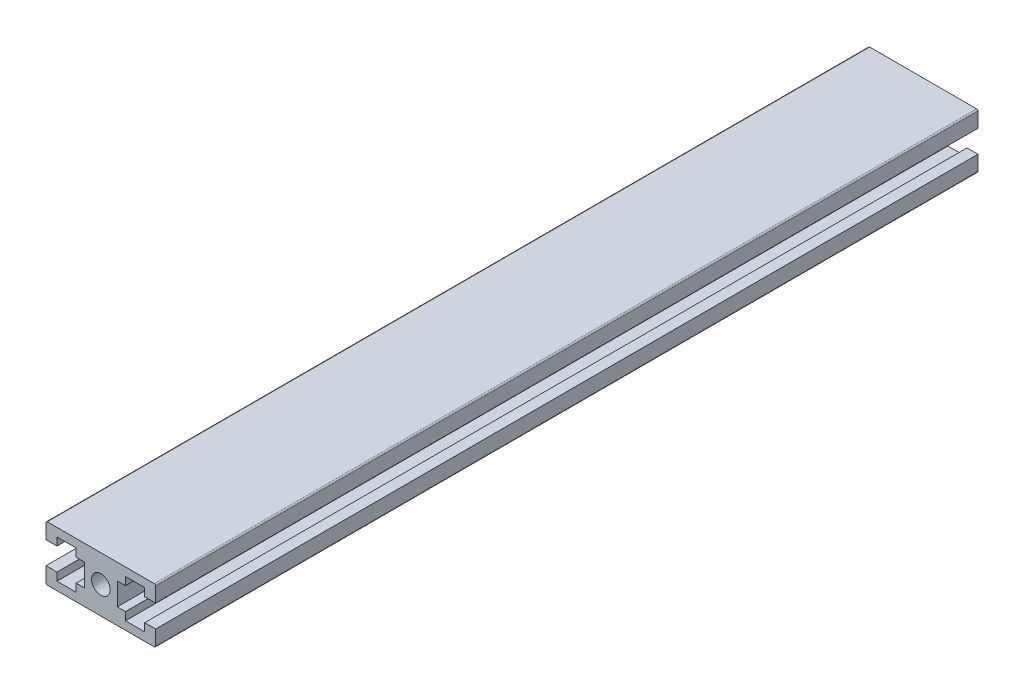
from build123d import *

# Parameters (mm, degrees)
SKETCH_1_R      = 3.4
EXTRUDE_1_DEPTH = 150


with BuildPart() as part:
    # Sketch 1 → Extrude 1 (new, symmetric)
    with BuildSketch(Plane.XY):
        with BuildLine():
            Line((9, -7), (9, -4.1))
            Line((9, -4.1), (6, -4.1))
            Line((6, -4.1), (6, 4.1))
            Line((6, 4.1), (9, 4.1))
            Line((9, 4.1), (9, 7))
            Line((9, 7), (16, 7))
            Line((16, 7), (16, 4.1))
            Line((16, 4.1), (20, 4.1))
            Line((20, 4.1), (20, 9.5))
            ThreePointArc((20, 9.5), (19.853553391, 9.853553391), (19.5, 10))
            Line((19.5, 10), (-19.5, 10))
            ThreePointArc((-19.5, 10), (-19.853553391, 9.853553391), (-20, 9.5))
            Line((-20, 9.5), (-20, 4.1))
            Line((-20, 4.1), (-16, 4.1))
            Line((-16, 4.1), (-16, 7))
            Line((-16, 7), (-9, 7))
            Line((-9, 7), (-9, 4.1))
            Line((-9, 4.1), (-6, 4.1))
            Line((-6, 4.1), (-6, -4.1))
            Line((-6, -4.1), (-9, -4.1))
            Line((-9, -4.1), (-9, -7))
            Line((-9, -7), (-16, -7))
            Line((-16, -7), (-16, -4.1))
            Line((-16, -4.1), (-20, -4.1))
            Line((-20, -4.1), (-20, -9.5))
            ThreePointArc((-20, -9.5), (-19.853553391, -9.853553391), (-19.5, -10))
            Line((-19.5, -10), (19.5, -10))
            ThreePointArc((19.5, -10), (19.853553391, -9.853553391), (20, -9.5))
            Line((20, -9.5), (20, -4.1))
            Line((20, -4.1), (16, -4.1))
            Line((16, -4.1), (16, -7))
            Line((16, -7), (9, -7))
        make_face()
        Circle(SKETCH_1_R, mode=Mode.SUBTRACT)
    extrude(amount=EXTRUDE_1_DEPTH, both=True)


solid = part.part
